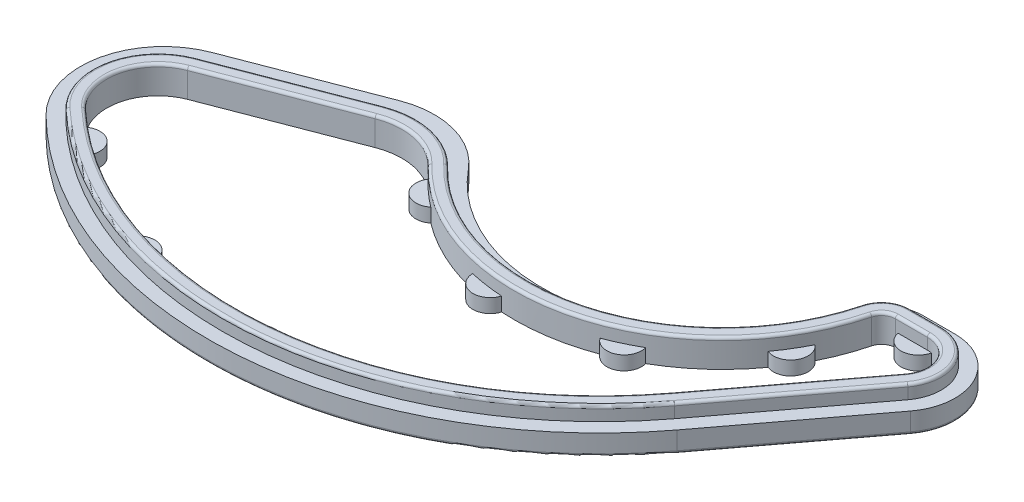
from build123d import *

# Parameters (mm, degrees)
ESTRUSIONE_ESTRUSIONE1_DEPTH = 1
TAGLIO_ESTRUSIONE2_DEPTH     = 36.898600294
SCHIZZO32_R                  = 1.25
ESTRUSIONE_ESTRUSIONE2_DEPTH = 1
ESTRUSIONE_ESTRUSIONE3_START = -0.5
ESTRUSIONE_ESTRUSIONE3_DEPTH = 0.5
ESTRUSIONE_ESTRUSIONE4_DEPTH = 2
RACCORDO1_R                  = 0.2
RACCORDO2_R                  = 0.2


with BuildPart() as part:
    # Schizzo30 → Estrusione-Estrusione1 (new body)
    with BuildSketch(Plane(origin=(0, 0, 0), x_dir=(1, 0, 0), z_dir=(0, 1, 0))):
        with BuildLine():
            Line((-17.802733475, 0.711832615), (-8.030360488, -3.039429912))
            ThreePointArc((-8.030360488, -3.039429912), (-4.347907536, -3.239001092), (-1.244315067, -1.24701661))
            ThreePointArc((-1.244315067, -1.24701661), (11.606068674, 3.193540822), (21.387195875, -6.25))
            ThreePointArc((21.387195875, -6.25), (22.454816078, -7.871708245), (24.291933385, -8.5))
            Line((24.291933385, -8.5), (26.59651946, -8.5))
            ThreePointArc((26.59651946, -8.5), (30.176256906, -6.284791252), (29.7910615, -2.092739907))
            Line((29.7910615, -2.092739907), (22.561453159, 7.501274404))
            ThreePointArc((22.561453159, 7.501274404), (2.042615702, 18.676057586), (-19.873431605, 10.57757994))
            ThreePointArc((-19.873431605, 10.57757994), (-21.524579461, 5.080843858), (-17.802733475, 0.711832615))
        make_face()
    extrude(amount=ESTRUSIONE_ESTRUSIONE1_DEPTH)

    # Schizzo31 → Taglio-Estrusione2 (cut, through all)
    with BuildSketch(Plane(origin=(0, 0, 0), x_dir=(1, 0, 0), z_dir=(0, 1, 0))):
        with BuildLine():
            Line((-16.727629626, 3.512573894), (-6.955256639, -0.238688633))
            ThreePointArc((-6.955256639, -0.238688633), (-4.333119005, -0.43011146), (-2.044266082, 0.863488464))
            ThreePointArc((-2.044266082, 0.863488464), (12.584057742, 5.014851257), (23.323687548, -5.75))
            ThreePointArc((23.323687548, -5.75), (23.679560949, -6.290569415), (24.291933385, -6.5))
            Line((24.291933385, -6.5), (26.59651946, -6.5))
            ThreePointArc((26.59651946, -6.5), (28.386388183, -5.392395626), (28.19379048, -3.296369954))
            Line((28.19379048, -3.296369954), (20.964182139, 6.297644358))
            ThreePointArc((20.964182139, 6.297644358), (2.269368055, 16.651720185), (-17.929557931, 9.672726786))
            ThreePointArc((-17.929557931, 9.672726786), (-19.034486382, 6.259807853), (-16.727629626, 3.512573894))
        make_face()
    extrude(amount=TAGLIO_ESTRUSIONE2_DEPTH, mode=Mode.SUBTRACT)

    # Schizzo32 → Estrusione-Estrusione2 (add)
    with BuildSketch(Plane(origin=(0, 0, 0), x_dir=(1, 0, 0), z_dir=(0, 1, 0))):
        with Locations((-1.026622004, 1.5)):
            Circle(SCHIZZO32_R)
        with Locations((6.67517635, 5.096151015)):
            Circle(SCHIZZO32_R)
        with Locations((15.08260416, 3.845088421)):
            Circle(SCHIZZO32_R)
        with Locations((21.403651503, -1.837724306)):
            Circle(SCHIZZO32_R)
        with Locations((25.7, -6.75)):
            Circle(SCHIZZO32_R)
        with Locations((25.7, 0.428411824)):
            Circle(SCHIZZO32_R)
        with Locations((19.5, 8.444358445)):
            Circle(SCHIZZO32_R)
        with Locations((11.461773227, 14.393048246)):
            Circle(SCHIZZO32_R)
        with Locations((1.791396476, 16.939381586)):
            Circle(SCHIZZO32_R)
        with Locations((-8.134074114, 15.720762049)):
            Circle(SCHIZZO32_R)
        with Locations((-16.901257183, 10.910720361)):
            Circle(SCHIZZO32_R)
    extrude(amount=ESTRUSIONE_ESTRUSIONE2_DEPTH)

    # Schizzo33 → Estrusione-Estrusione3 (add)
    with BuildSketch(Plane(origin=(0, 0, 0), x_dir=(1, 0, 0), z_dir=(0, 1, 0)).offset(ESTRUSIONE_ESTRUSIONE3_START)):
        with BuildLine():
            Line((24.291933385, -8.5), (26.59651946, -8.5))
            ThreePointArc((26.59651946, -8.5), (30.176256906, -6.284791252), (29.7910615, -2.092739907))
            Line((29.7910615, -2.092739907), (22.561453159, 7.501274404))
            ThreePointArc((22.561453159, 7.501274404), (2.042615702, 18.676057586), (-19.873431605, 10.57757994))
            ThreePointArc((-19.873431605, 10.57757994), (-21.524579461, 5.080843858), (-17.802733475, 0.711832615))
            Line((-17.802733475, 0.711832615), (-8.030360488, -3.039429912))
            ThreePointArc((-8.030360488, -3.039429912), (-4.347907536, -3.239001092), (-1.244315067, -1.24701661))
            ThreePointArc((-1.244315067, -1.24701661), (11.606068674, 3.193540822), (21.387195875, -6.25))
            ThreePointArc((21.387195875, -6.25), (22.454816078, -7.871708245), (24.291933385, -8.5))
        make_face()
        with BuildLine():
            Line((24.291933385, -7.5), (26.59651946, -7.5))
            ThreePointArc((26.59651946, -7.5), (29.281322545, -5.838593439), (28.99242599, -2.694554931))
            Line((28.99242599, -2.694554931), (21.762817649, 6.899459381))
            ThreePointArc((21.762817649, 6.899459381), (1.970310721, 17.678675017), (-19.169947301, 9.866869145))
            ThreePointArc((-19.169947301, 9.866869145), (-20.545903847, 5.286255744), (-17.444365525, 1.645413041))
            Line((-17.444365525, 1.645413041), (-7.671992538, -2.105849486))
            ThreePointArc((-7.671992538, -2.105849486), (-4.603281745, -2.272158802), (-2.016954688, -0.612171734))
            ThreePointArc((-2.016954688, -0.612171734), (11.82192011, 4.169967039), (22.355441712, -6))
            ThreePointArc((22.355441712, -6), (23.067188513, -7.08113883), (24.291933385, -7.5))
        make_face(mode=Mode.SUBTRACT)
    extrude(amount=ESTRUSIONE_ESTRUSIONE3_DEPTH)

    # Schizzo34 → Estrusione-Estrusione4 (add)
    with BuildSketch(Plane(origin=(0, 0, 0), x_dir=(1, 0, 0), z_dir=(0, 1, 0))):
        with BuildLine():
            Line((24.291933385, -7.5), (26.59651946, -7.5))
            ThreePointArc((26.59651946, -7.5), (29.281322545, -5.838593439), (28.99242599, -2.694554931))
            Line((28.99242599, -2.694554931), (21.762817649, 6.899459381))
            ThreePointArc((21.762817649, 6.899459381), (2.355820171, 17.647976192), (-18.612588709, 10.403116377))
            ThreePointArc((-18.612588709, 10.403116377), (-20.015978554, 6.06830559), (-17.085997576, 2.578993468))
            Line((-17.085997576, 2.578993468), (-7.313624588, -1.172269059))
            ThreePointArc((-7.313624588, -1.172269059), (-4.11413555, -1.405840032), (-1.32131501, 0.172589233))
            ThreePointArc((-1.32131501, 0.172589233), (12.331787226, 4.047194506), (22.355441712, -6))
            ThreePointArc((22.355441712, -6), (23.067188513, -7.08113883), (24.291933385, -7.5))
        make_face()
        with BuildLine():
            Line((24.291933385, -6.5), (26.59651946, -6.5))
            ThreePointArc((26.59651946, -6.5), (28.386388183, -5.392395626), (28.19379048, -3.296369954))
            Line((28.19379048, -3.296369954), (20.964182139, 6.297644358))
            ThreePointArc((20.964182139, 6.297644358), (2.269368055, 16.651720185), (-17.929557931, 9.672726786))
            ThreePointArc((-17.929557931, 9.672726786), (-19.034486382, 6.259807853), (-16.727629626, 3.512573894))
            Line((-16.727629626, 3.512573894), (-6.955256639, -0.238688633))
            ThreePointArc((-6.955256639, -0.238688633), (-4.333119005, -0.43011146), (-2.044266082, 0.863488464))
            ThreePointArc((-2.044266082, 0.863488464), (12.584057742, 5.014851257), (23.323687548, -5.75))
            ThreePointArc((23.323687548, -5.75), (23.679560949, -6.290569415), (24.291933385, -6.5))
        make_face(mode=Mode.SUBTRACT)
    extrude(amount=ESTRUSIONE_ESTRUSIONE4_DEPTH)

    # Raccordo1
    raccordo1_edges = [part.edges().sort_by_distance(p)[0] for p in [
        (-4.347907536, -0.5, 3.239001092),
        (-12.916546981, -0.5, 1.163798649),
        (-21.524579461, -0.5, -5.080843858),
        (2.042615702, -0.5, -18.676057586),
        (26.176257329, -0.5, -2.704267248),
        (30.176256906, -0.5, 6.284791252),
        (25.444226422, -0.5, 8.5),
        (22.454816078, -0.5, 7.871708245),
        (11.606068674, -0.5, -3.193540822),
        (-12.558179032, -0.5, 0.230218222),
        (-4.603281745, -0.5, 2.272158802),
        (11.82192011, -0.5, -4.169967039),
        (23.067188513, -0.5, 7.08113883),
        (25.444226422, -0.5, 7.5),
        (29.281322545, -0.5, 5.838593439),
        (25.377621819, -0.5, -2.102452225),
        (1.970310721, -0.5, -17.678675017),
        (-20.545903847, -0.5, -5.286255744),
    ]]
    fillet(raccordo1_edges, radius=RACCORDO1_R)

    # Raccordo2
    raccordo2_edges = [part.edges().sort_by_distance(p)[0] for p in [
        (12.584057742, 2, -5.014851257),
        (23.067188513, 2, 7.08113883),
        (25.444226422, 2, 7.5),
        (29.281322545, 2, 5.838593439),
        (25.377621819, 2, -2.102452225),
        (2.355820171, 2, -17.647976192),
        (-20.015978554, 2, -6.06830559),
        (-12.199811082, 2, -0.703362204),
        (-4.11413555, 2, 1.405840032),
        (12.331787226, 2, -4.047194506),
        (23.679560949, 2, 6.290569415),
        (25.444226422, 2, 6.5),
        (28.386388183, 2, 5.392395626),
        (24.578986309, 2, -1.500637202),
        (2.269368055, 2, -16.651720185),
        (-19.034486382, 2, -6.259807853),
        (-11.841443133, 2, -1.636942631),
        (-4.333119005, 2, 0.43011146),
    ]]
    fillet(raccordo2_edges, radius=RACCORDO2_R)


with BuildPart() as body_2:
    # Specchia7: mirrored copy
    add(part.part.mirror(Plane.XY.offset(9.5)))


solid = body_2.part
